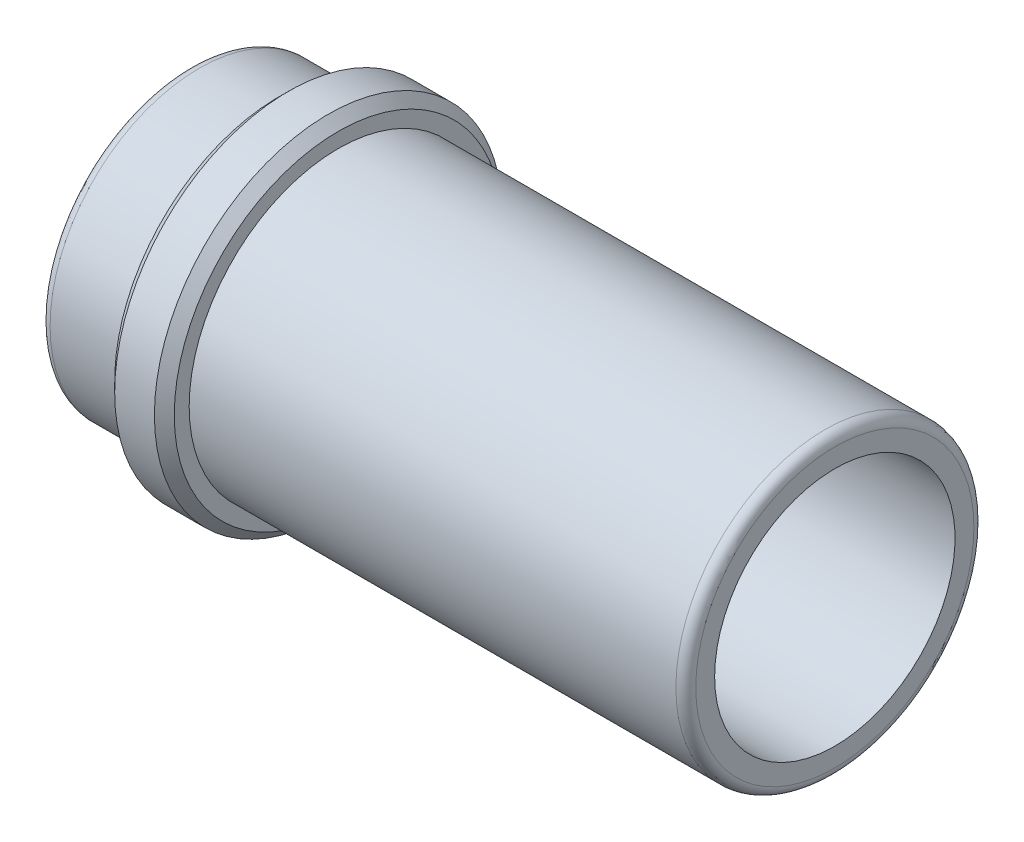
ISO-10303-21;
HEADER;
FILE_DESCRIPTION(('STEP AP214'),'2;1');
FILE_NAME('part.step','',(''),(''),'','','');
FILE_SCHEMA(('AUTOMOTIVE_DESIGN { 1 0 10303 214 1 1 1 1 }'));
ENDSEC;
DATA;
#1=APPLICATION_CONTEXT('core data for automotive mechanical design processes');
#2=APPLICATION_PROTOCOL_DEFINITION('international standard','automotive_design',2000,#1);
#3=PRODUCT_CONTEXT('',#1,'mechanical');
#4=PRODUCT('Part','Part','',(#3));
#5=PRODUCT_RELATED_PRODUCT_CATEGORY('part','',(#4));
#6=PRODUCT_DEFINITION_FORMATION('','',#4);
#7=PRODUCT_DEFINITION_CONTEXT('part definition',#1,'design');
#8=PRODUCT_DEFINITION('design','',#6,#7);
#9=PRODUCT_DEFINITION_SHAPE('','',#8);
#10=(LENGTH_UNIT() NAMED_UNIT(*) SI_UNIT(.MILLI.,.METRE.));
#11=(NAMED_UNIT(*) PLANE_ANGLE_UNIT() SI_UNIT($,.RADIAN.));
#12=(NAMED_UNIT(*) SI_UNIT($,.STERADIAN.) SOLID_ANGLE_UNIT());
#13=UNCERTAINTY_MEASURE_WITH_UNIT(LENGTH_MEASURE(1.E-05),#10,'distance_accuracy_value','');
#14=(GEOMETRIC_REPRESENTATION_CONTEXT(3) GLOBAL_UNCERTAINTY_ASSIGNED_CONTEXT((#13)) GLOBAL_UNIT_ASSIGNED_CONTEXT((#10,
#11,#12)) REPRESENTATION_CONTEXT('',''));
#15=CARTESIAN_POINT('',(0.,0.,0.));
#16=DIRECTION('',(0.,0.,1.));
#17=DIRECTION('',(1.,0.,0.));
#18=AXIS2_PLACEMENT_3D('',#15,#16,#17);
#19=CARTESIAN_POINT('',(9.,15.,0.));
#20=DIRECTION('',(1.,0.,0.));
#21=DIRECTION('',(0.,0.,-1.));
#22=AXIS2_PLACEMENT_3D('',#19,#20,#21);
#23=PLANE('',#22);
#24=CARTESIAN_POINT('',(9.,0.,0.));
#25=DIRECTION('',(1.,0.,0.));
#26=DIRECTION('',(0.,0.,-1.));
#27=AXIS2_PLACEMENT_3D('',#24,#25,#26);
#28=CIRCLE('',#27,16.5);
#29=CARTESIAN_POINT('',(9.,0.,-16.5));
#30=VERTEX_POINT('',#29);
#31=EDGE_CURVE('E9',#30,#30,#28,.F.);
#32=ORIENTED_EDGE('',*,*,#31,.T.);
#33=EDGE_LOOP('',(#32));
#34=FACE_BOUND('',#33,.T.);
#35=CARTESIAN_POINT('',(9.,0.,0.));
#36=DIRECTION('',(-1.,0.,0.));
#37=DIRECTION('',(0.,0.,1.));
#38=AXIS2_PLACEMENT_3D('',#35,#36,#37);
#39=CIRCLE('',#38,15.);
#40=CARTESIAN_POINT('',(9.,0.,15.));
#41=VERTEX_POINT('',#40);
#42=EDGE_CURVE('E55',#41,#41,#39,.T.);
#43=ORIENTED_EDGE('',*,*,#42,.F.);
#44=EDGE_LOOP('',(#43));
#45=FACE_BOUND('',#44,.T.);
#46=ADVANCED_FACE('F14',(#34,#45),#23,.F.);
#47=CARTESIAN_POINT('',(0.,0.,0.));
#48=DIRECTION('',(-1.,0.,0.));
#49=DIRECTION('',(0.,0.,1.));
#50=AXIS2_PLACEMENT_3D('',#47,#48,#49);
#51=CYLINDRICAL_SURFACE('',#50,17.5);
#52=CARTESIAN_POINT('',(14.,0.,0.));
#53=DIRECTION('',(-1.,0.,0.));
#54=DIRECTION('',(0.,0.,1.));
#55=AXIS2_PLACEMENT_3D('',#52,#53,#54);
#56=CIRCLE('',#55,17.5);
#57=CARTESIAN_POINT('',(14.,0.,17.5));
#58=VERTEX_POINT('',#57);
#59=EDGE_CURVE('E25',#58,#58,#56,.T.);
#60=ORIENTED_EDGE('',*,*,#59,.T.);
#61=EDGE_LOOP('',(#60));
#62=FACE_BOUND('',#61,.T.);
#63=CARTESIAN_POINT('',(10.,0.,0.));
#64=DIRECTION('',(1.,0.,0.));
#65=DIRECTION('',(0.,0.,-1.));
#66=AXIS2_PLACEMENT_3D('',#63,#64,#65);
#67=CIRCLE('',#66,17.5);
#68=CARTESIAN_POINT('',(10.,0.,-17.5));
#69=VERTEX_POINT('',#68);
#70=EDGE_CURVE('E29',#69,#69,#67,.T.);
#71=ORIENTED_EDGE('',*,*,#70,.T.);
#72=EDGE_LOOP('',(#71));
#73=FACE_BOUND('',#72,.T.);
#74=ADVANCED_FACE('F62',(#62,#73),#51,.T.);
#75=CARTESIAN_POINT('',(15.,17.5,0.));
#76=DIRECTION('',(-1.,0.,0.));
#77=DIRECTION('',(0.,0.,1.));
#78=AXIS2_PLACEMENT_3D('',#75,#76,#77);
#79=PLANE('',#78);
#80=CARTESIAN_POINT('',(15.,0.,0.));
#81=DIRECTION('',(-1.,0.,0.));
#82=DIRECTION('',(0.,0.,1.));
#83=AXIS2_PLACEMENT_3D('',#80,#81,#82);
#84=CIRCLE('',#83,16.5);
#85=CARTESIAN_POINT('',(15.,0.,16.5));
#86=VERTEX_POINT('',#85);
#87=EDGE_CURVE('E21',#86,#86,#84,.F.);
#88=ORIENTED_EDGE('',*,*,#87,.T.);
#89=EDGE_LOOP('',(#88));
#90=FACE_BOUND('',#89,.T.);
#91=CARTESIAN_POINT('',(15.,0.,0.));
#92=DIRECTION('',(-1.,0.,0.));
#93=DIRECTION('',(0.,0.,1.));
#94=AXIS2_PLACEMENT_3D('',#91,#92,#93);
#95=CIRCLE('',#94,15.);
#96=CARTESIAN_POINT('',(15.,0.,15.));
#97=VERTEX_POINT('',#96);
#98=EDGE_CURVE('E46',#97,#97,#95,.T.);
#99=ORIENTED_EDGE('',*,*,#98,.T.);
#100=EDGE_LOOP('',(#99));
#101=FACE_BOUND('',#100,.T.);
#102=ADVANCED_FACE('F69',(#90,#101),#79,.F.);
#103=CARTESIAN_POINT('',(0.,0.,0.));
#104=DIRECTION('',(-1.,0.,0.));
#105=DIRECTION('',(0.,0.,1.));
#106=AXIS2_PLACEMENT_3D('',#103,#104,#105);
#107=CYLINDRICAL_SURFACE('',#106,15.);
#108=CARTESIAN_POINT('',(64.,0.,0.));
#109=DIRECTION('',(-1.,0.,0.));
#110=DIRECTION('',(0.,0.,1.));
#111=AXIS2_PLACEMENT_3D('',#108,#109,#110);
#112=CIRCLE('',#111,15.);
#113=CARTESIAN_POINT('',(64.,0.,15.));
#114=VERTEX_POINT('',#113);
#115=EDGE_CURVE('E43',#114,#114,#112,.T.);
#116=ORIENTED_EDGE('',*,*,#115,.T.);
#117=EDGE_LOOP('',(#116));
#118=FACE_BOUND('',#117,.T.);
#119=ORIENTED_EDGE('',*,*,#98,.F.);
#120=EDGE_LOOP('',(#119));
#121=FACE_BOUND('',#120,.T.);
#122=ADVANCED_FACE('F114',(#118,#121),#107,.T.);
#123=CARTESIAN_POINT('',(65.,15.,0.));
#124=DIRECTION('',(-1.,0.,0.));
#125=DIRECTION('',(0.,0.,1.));
#126=AXIS2_PLACEMENT_3D('',#123,#124,#125);
#127=PLANE('',#126);
#128=CARTESIAN_POINT('',(65.,0.,0.));
#129=DIRECTION('',(-1.,0.,0.));
#130=DIRECTION('',(0.,0.,1.));
#131=AXIS2_PLACEMENT_3D('',#128,#129,#130);
#132=CIRCLE('',#131,14.);
#133=CARTESIAN_POINT('',(65.,0.,14.));
#134=VERTEX_POINT('',#133);
#135=EDGE_CURVE('E40',#134,#134,#132,.F.);
#136=ORIENTED_EDGE('',*,*,#135,.T.);
#137=EDGE_LOOP('',(#136));
#138=FACE_BOUND('',#137,.T.);
#139=CARTESIAN_POINT('',(65.,0.,0.));
#140=DIRECTION('',(-1.,0.,0.));
#141=DIRECTION('',(0.,0.,1.));
#142=AXIS2_PLACEMENT_3D('',#139,#140,#141);
#143=CIRCLE('',#142,12.1);
#144=CARTESIAN_POINT('',(65.,0.,12.1));
#145=VERTEX_POINT('',#144);
#146=EDGE_CURVE('E49',#145,#145,#143,.T.);
#147=ORIENTED_EDGE('',*,*,#146,.T.);
#148=EDGE_LOOP('',(#147));
#149=FACE_BOUND('',#148,.T.);
#150=ADVANCED_FACE('F144',(#138,#149),#127,.F.);
#151=CARTESIAN_POINT('',(0.,0.,0.));
#152=DIRECTION('',(-1.,0.,0.));
#153=DIRECTION('',(0.,0.,1.));
#154=AXIS2_PLACEMENT_3D('',#151,#152,#153);
#155=CYLINDRICAL_SURFACE('',#154,12.1);
#156=ORIENTED_EDGE('',*,*,#146,.F.);
#157=EDGE_LOOP('',(#156));
#158=FACE_BOUND('',#157,.T.);
#159=CARTESIAN_POINT('',(0.,0.,0.));
#160=DIRECTION('',(-1.,0.,0.));
#161=DIRECTION('',(0.,0.,1.));
#162=AXIS2_PLACEMENT_3D('',#159,#160,#161);
#163=CIRCLE('',#162,12.1);
#164=CARTESIAN_POINT('',(0.,0.,12.1));
#165=VERTEX_POINT('',#164);
#166=EDGE_CURVE('E52',#165,#165,#163,.T.);
#167=ORIENTED_EDGE('',*,*,#166,.T.);
#168=EDGE_LOOP('',(#167));
#169=FACE_BOUND('',#168,.T.);
#170=ADVANCED_FACE('F136',(#158,#169),#155,.F.);
#171=CARTESIAN_POINT('',(0.,12.1,0.));
#172=DIRECTION('',(1.,0.,0.));
#173=DIRECTION('',(0.,0.,-1.));
#174=AXIS2_PLACEMENT_3D('',#171,#172,#173);
#175=PLANE('',#174);
#176=CARTESIAN_POINT('',(0.,0.,0.));
#177=DIRECTION('',(1.,0.,0.));
#178=DIRECTION('',(0.,0.,-1.));
#179=AXIS2_PLACEMENT_3D('',#176,#177,#178);
#180=CIRCLE('',#179,14.);
#181=CARTESIAN_POINT('',(0.,0.,-14.));
#182=VERTEX_POINT('',#181);
#183=EDGE_CURVE('E37',#182,#182,#180,.F.);
#184=ORIENTED_EDGE('',*,*,#183,.T.);
#185=EDGE_LOOP('',(#184));
#186=FACE_BOUND('',#185,.T.);
#187=ORIENTED_EDGE('',*,*,#166,.F.);
#188=EDGE_LOOP('',(#187));
#189=FACE_BOUND('',#188,.T.);
#190=ADVANCED_FACE('F125',(#186,#189),#175,.F.);
#191=CARTESIAN_POINT('',(0.,0.,0.));
#192=DIRECTION('',(-1.,0.,0.));
#193=DIRECTION('',(0.,0.,1.));
#194=AXIS2_PLACEMENT_3D('',#191,#192,#193);
#195=CYLINDRICAL_SURFACE('',#194,15.);
#196=CARTESIAN_POINT('',(1.,0.,0.));
#197=DIRECTION('',(1.,0.,0.));
#198=DIRECTION('',(0.,0.,-1.));
#199=AXIS2_PLACEMENT_3D('',#196,#197,#198);
#200=CIRCLE('',#199,15.);
#201=CARTESIAN_POINT('',(1.,0.,-15.));
#202=VERTEX_POINT('',#201);
#203=EDGE_CURVE('E34',#202,#202,#200,.T.);
#204=ORIENTED_EDGE('',*,*,#203,.T.);
#205=EDGE_LOOP('',(#204));
#206=FACE_BOUND('',#205,.T.);
#207=ORIENTED_EDGE('',*,*,#42,.T.);
#208=EDGE_LOOP('',(#207));
#209=FACE_BOUND('',#208,.T.);
#210=ADVANCED_FACE('F59',(#206,#209),#195,.T.);
#211=CARTESIAN_POINT('',(64.,0.,0.));
#212=DIRECTION('',(-1.,0.,0.));
#213=DIRECTION('',(0.,0.,1.));
#214=AXIS2_PLACEMENT_3D('',#211,#212,#213);
#215=TOROIDAL_SURFACE('',#214,14.,1.);
#216=ORIENTED_EDGE('',*,*,#135,.F.);
#217=EDGE_LOOP('',(#216));
#218=FACE_BOUND('',#217,.T.);
#219=ORIENTED_EDGE('',*,*,#115,.F.);
#220=EDGE_LOOP('',(#219));
#221=FACE_BOUND('',#220,.T.);
#222=ADVANCED_FACE('F74',(#218,#221),#215,.T.);
#223=CARTESIAN_POINT('',(1.,0.,0.));
#224=DIRECTION('',(1.,0.,0.));
#225=DIRECTION('',(0.,0.,-1.));
#226=AXIS2_PLACEMENT_3D('',#223,#224,#225);
#227=TOROIDAL_SURFACE('',#226,14.,1.);
#228=ORIENTED_EDGE('',*,*,#203,.F.);
#229=EDGE_LOOP('',(#228));
#230=FACE_BOUND('',#229,.T.);
#231=ORIENTED_EDGE('',*,*,#183,.F.);
#232=EDGE_LOOP('',(#231));
#233=FACE_BOUND('',#232,.T.);
#234=ADVANCED_FACE('F77',(#230,#233),#227,.T.);
#235=CARTESIAN_POINT('',(14.,0.,0.));
#236=DIRECTION('',(-1.,0.,0.));
#237=DIRECTION('',(0.,0.,1.));
#238=AXIS2_PLACEMENT_3D('',#235,#236,#237);
#239=CONICAL_SURFACE('',#238,17.5,0.785398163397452);
#240=ORIENTED_EDGE('',*,*,#87,.F.);
#241=EDGE_LOOP('',(#240));
#242=FACE_BOUND('',#241,.T.);
#243=ORIENTED_EDGE('',*,*,#59,.F.);
#244=EDGE_LOOP('',(#243));
#245=FACE_BOUND('',#244,.T.);
#246=ADVANCED_FACE('F80',(#242,#245),#239,.T.);
#247=CARTESIAN_POINT('',(9.,0.,0.));
#248=DIRECTION('',(1.,0.,0.));
#249=DIRECTION('',(0.,0.,-1.));
#250=AXIS2_PLACEMENT_3D('',#247,#248,#249);
#251=CONICAL_SURFACE('',#250,16.5,0.785398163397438);
#252=ORIENTED_EDGE('',*,*,#70,.F.);
#253=EDGE_LOOP('',(#252));
#254=FACE_BOUND('',#253,.T.);
#255=ORIENTED_EDGE('',*,*,#31,.F.);
#256=EDGE_LOOP('',(#255));
#257=FACE_BOUND('',#256,.T.);
#258=ADVANCED_FACE('F16',(#254,#257),#251,.T.);
#259=CLOSED_SHELL('',(#46,#74,#102,#122,#150,#170,#190,#210,#222,#234,#246,#258));
#260=MANIFOLD_SOLID_BREP('B1',#259);
#261=ADVANCED_BREP_SHAPE_REPRESENTATION('',(#18,#260),#14);
#262=SHAPE_DEFINITION_REPRESENTATION(#9,#261);
ENDSEC;
END-ISO-10303-21;
